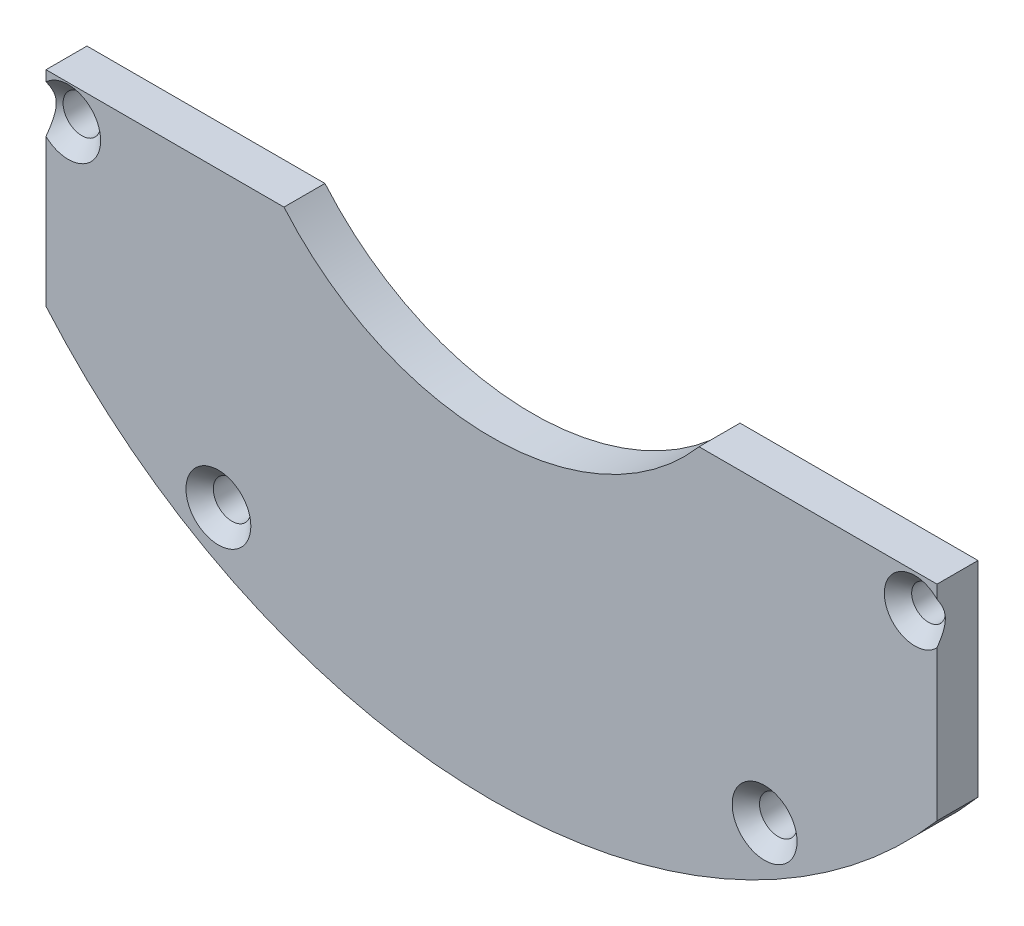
ISO-10303-21;
HEADER;
FILE_DESCRIPTION(('STEP AP214'),'2;1');
FILE_NAME('part.step','',(''),(''),'','','');
FILE_SCHEMA(('AUTOMOTIVE_DESIGN { 1 0 10303 214 1 1 1 1 }'));
ENDSEC;
DATA;
#1=APPLICATION_CONTEXT('core data for automotive mechanical design processes');
#2=APPLICATION_PROTOCOL_DEFINITION('international standard','automotive_design',2000,#1);
#3=PRODUCT_CONTEXT('',#1,'mechanical');
#4=PRODUCT('Part','Part','',(#3));
#5=PRODUCT_RELATED_PRODUCT_CATEGORY('part','',(#4));
#6=PRODUCT_DEFINITION_FORMATION('','',#4);
#7=PRODUCT_DEFINITION_CONTEXT('part definition',#1,'design');
#8=PRODUCT_DEFINITION('design','',#6,#7);
#9=PRODUCT_DEFINITION_SHAPE('','',#8);
#10=(LENGTH_UNIT() NAMED_UNIT(*) SI_UNIT(.MILLI.,.METRE.));
#11=(NAMED_UNIT(*) PLANE_ANGLE_UNIT() SI_UNIT($,.RADIAN.));
#12=(NAMED_UNIT(*) SI_UNIT($,.STERADIAN.) SOLID_ANGLE_UNIT());
#13=UNCERTAINTY_MEASURE_WITH_UNIT(LENGTH_MEASURE(1.E-05),#10,'distance_accuracy_value','');
#14=(GEOMETRIC_REPRESENTATION_CONTEXT(3) GLOBAL_UNCERTAINTY_ASSIGNED_CONTEXT((#13)) GLOBAL_UNIT_ASSIGNED_CONTEXT((#10,
#11,#12)) REPRESENTATION_CONTEXT('',''));
#15=CARTESIAN_POINT('',(0.,0.,0.));
#16=DIRECTION('',(0.,0.,1.));
#17=DIRECTION('',(1.,0.,0.));
#18=AXIS2_PLACEMENT_3D('',#15,#16,#17);
#19=CARTESIAN_POINT('',(-65.25,-26.,6.));
#20=DIRECTION('',(0.,-1.,0.));
#21=DIRECTION('',(1.,0.,0.));
#22=AXIS2_PLACEMENT_3D('',#19,#20,#21);
#23=PLANE('',#22);
#24=DIRECTION('',(-1.,0.,0.));
#25=VECTOR('',#24,1.);
#26=CARTESIAN_POINT('',(-65.25,-26.,0.));
#27=LINE('',#26,#25);
#28=CARTESIAN_POINT('',(-30.3973683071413,-26.,0.));
#29=VERTEX_POINT('',#28);
#30=CARTESIAN_POINT('',(-65.25,-26.,0.));
#31=VERTEX_POINT('',#30);
#32=EDGE_CURVE('E128',#29,#31,#27,.T.);
#33=ORIENTED_EDGE('',*,*,#32,.T.);
#34=DIRECTION('',(0.,0.,-1.));
#35=VECTOR('',#34,1.);
#36=CARTESIAN_POINT('',(-65.25,-26.,6.));
#37=LINE('',#36,#35);
#38=CARTESIAN_POINT('',(-65.25,-26.,6.));
#39=VERTEX_POINT('',#38);
#40=EDGE_CURVE('E109',#39,#31,#37,.T.);
#41=ORIENTED_EDGE('',*,*,#40,.F.);
#42=DIRECTION('',(-1.,0.,0.));
#43=VECTOR('',#42,1.);
#44=CARTESIAN_POINT('',(-65.25,-26.,6.));
#45=LINE('',#44,#43);
#46=CARTESIAN_POINT('',(-30.3973683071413,-26.,6.));
#47=VERTEX_POINT('',#46);
#48=EDGE_CURVE('E118',#47,#39,#45,.T.);
#49=ORIENTED_EDGE('',*,*,#48,.F.);
#50=DIRECTION('',(0.,0.,-1.));
#51=VECTOR('',#50,1.);
#52=CARTESIAN_POINT('',(-30.3973683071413,-26.,6.));
#53=LINE('',#52,#51);
#54=EDGE_CURVE('E350',#47,#29,#53,.T.);
#55=ORIENTED_EDGE('',*,*,#54,.T.);
#56=EDGE_LOOP('',(#33,#41,#49,#55));
#57=FACE_BOUND('',#56,.T.);
#58=ADVANCED_FACE('F35',(#57),#23,.F.);
#59=CARTESIAN_POINT('',(-65.25,-26.,6.));
#60=DIRECTION('',(1.,0.,0.));
#61=DIRECTION('',(0.,0.,-1.));
#62=AXIS2_PLACEMENT_3D('',#59,#60,#61);
#63=PLANE('',#62);
#64=DIRECTION('',(0.,-1.,0.));
#65=VECTOR('',#64,1.);
#66=CARTESIAN_POINT('',(-65.25,-26.,6.));
#67=LINE('',#66,#65);
#68=CARTESIAN_POINT('',(-65.25,-34.4641016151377,6.));
#69=VERTEX_POINT('',#68);
#70=CARTESIAN_POINT('',(-65.25,-56.0217591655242,6.));
#71=VERTEX_POINT('',#70);
#72=EDGE_CURVE('E115',#69,#71,#67,.T.);
#73=ORIENTED_EDGE('',*,*,#72,.F.);
#74=CARTESIAN_POINT('',(-65.25,-34.4641016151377,6.));
#75=CARTESIAN_POINT('',(-65.25,-34.3719398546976,5.93280747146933));
#76=CARTESIAN_POINT('',(-65.25,-34.2791909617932,5.86640449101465));
#77=CARTESIAN_POINT('',(-65.25,-34.092276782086,5.73555140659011));
#78=CARTESIAN_POINT('',(-65.25,-33.9981109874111,5.67110202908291));
#79=CARTESIAN_POINT('',(-65.25,-33.807139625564,5.54388129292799));
#80=CARTESIAN_POINT('',(-65.25,-33.7103163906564,5.48113632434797));
#81=CARTESIAN_POINT('',(-65.25,-33.5148039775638,5.3586408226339));
#82=CARTESIAN_POINT('',(-65.25,-33.4161149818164,5.29888999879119));
#83=CARTESIAN_POINT('',(-65.25,-33.2121673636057,5.1805200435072));
#84=CARTESIAN_POINT('',(-65.25,-33.1068109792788,5.12206710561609));
#85=CARTESIAN_POINT('',(-65.25,-32.8934491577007,5.01023799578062));
#86=CARTESIAN_POINT('',(-65.25,-32.7854432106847,4.95686281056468));
#87=CARTESIAN_POINT('',(-65.25,-32.4578778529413,4.80673331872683));
#88=CARTESIAN_POINT('',(-65.25,-32.2336780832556,4.71931072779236));
#89=CARTESIAN_POINT('',(-65.25,-31.8957625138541,4.6196115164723));
#90=CARTESIAN_POINT('',(-65.25,-31.7865245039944,4.59207234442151));
#91=CARTESIAN_POINT('',(-65.25,-31.5659169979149,4.54713679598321));
#92=CARTESIAN_POINT('',(-65.25,-31.4545472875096,4.52974144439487));
#93=CARTESIAN_POINT('',(-65.25,-31.2324607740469,4.5064635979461));
#94=CARTESIAN_POINT('',(-65.25,-31.1217637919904,4.50039489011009));
#95=CARTESIAN_POINT('',(-65.25,-30.9003322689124,4.49964266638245));
#96=CARTESIAN_POINT('',(-65.25,-30.7895977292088,4.50495878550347));
#97=CARTESIAN_POINT('',(-65.25,-30.5696302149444,4.52654860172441));
#98=CARTESIAN_POINT('',(-65.25,-30.4603932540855,4.54278253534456));
#99=CARTESIAN_POINT('',(-65.25,-30.243862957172,4.58510943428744));
#100=CARTESIAN_POINT('',(-65.25,-30.1365699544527,4.61120407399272));
#101=CARTESIAN_POINT('',(-65.25,-29.9227315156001,4.67232802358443));
#102=CARTESIAN_POINT('',(-65.25,-29.8162256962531,4.70749397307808));
#103=CARTESIAN_POINT('',(-65.25,-29.6059102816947,4.7850293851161));
#104=CARTESIAN_POINT('',(-65.25,-29.502100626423,4.82739868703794));
#105=CARTESIAN_POINT('',(-65.25,-29.2298253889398,4.94766960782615));
#106=CARTESIAN_POINT('',(-65.25,-29.0636119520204,5.03064924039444));
#107=CARTESIAN_POINT('',(-65.25,-28.7371461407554,5.20780232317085));
#108=CARTESIAN_POINT('',(-65.25,-28.5769014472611,5.30198958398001));
#109=CARTESIAN_POINT('',(-65.25,-28.2677351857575,5.49425924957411));
#110=CARTESIAN_POINT('',(-65.25,-28.1186178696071,5.59202943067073));
#111=CARTESIAN_POINT('',(-65.25,-27.8979076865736,5.7425058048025));
#112=CARTESIAN_POINT('',(-65.25,-27.824941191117,5.79322103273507));
#113=CARTESIAN_POINT('',(-65.25,-27.6798301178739,5.89579391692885));
#114=CARTESIAN_POINT('',(-65.25,-27.607685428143,5.94765141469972));
#115=CARTESIAN_POINT('',(-65.25,-27.5358983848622,6.));
#116=B_SPLINE_CURVE_WITH_KNOTS('',3,(#74,#75,#76,#77,#78,#79,#80,#81,#82,#83,#84,#85,#86,#87,
#88,#89,#90,#91,#92,#93,#94,#95,#96,#97,#98,#99,#100,#101,#102,#103,#104,#105,#106,#107,#108,
#109,#110,#111,#112,#113,#114,#115),.UNSPECIFIED.,.F.,.F.,(4,2,2,2,2,2,2,2,2,2,2,2,2,2,2,2,2,2,
2,2,4),(0.,0.342175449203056,0.684476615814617,1.03055784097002,1.37660539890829,
1.73791808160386,2.09930083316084,2.81824374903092,3.15582730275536,3.49344495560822,
3.82546145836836,4.15746731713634,4.48827048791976,4.81912985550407,5.15529788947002,
5.49145842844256,6.04810927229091,6.60545329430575,7.14022586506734,7.4067985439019,
7.67333446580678),.UNSPECIFIED.);
#117=CARTESIAN_POINT('',(-65.25,-27.5358983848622,6.));
#118=VERTEX_POINT('',#117);
#119=EDGE_CURVE('E11',#69,#118,#116,.T.);
#120=ORIENTED_EDGE('',*,*,#119,.T.);
#121=EDGE_CURVE('E104',#39,#118,#67,.T.);
#122=ORIENTED_EDGE('',*,*,#121,.F.);
#123=ORIENTED_EDGE('',*,*,#40,.T.);
#124=DIRECTION('',(0.,-1.,0.));
#125=VECTOR('',#124,1.);
#126=CARTESIAN_POINT('',(-65.25,-26.,0.));
#127=LINE('',#126,#125);
#128=CARTESIAN_POINT('',(-65.25,-56.0217591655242,0.));
#129=VERTEX_POINT('',#128);
#130=EDGE_CURVE('E337',#31,#129,#127,.T.);
#131=ORIENTED_EDGE('',*,*,#130,.T.);
#132=DIRECTION('',(0.,0.,-1.));
#133=VECTOR('',#132,1.);
#134=CARTESIAN_POINT('',(-65.25,-56.0217591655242,6.));
#135=LINE('',#134,#133);
#136=EDGE_CURVE('E130',#71,#129,#135,.T.);
#137=ORIENTED_EDGE('',*,*,#136,.F.);
#138=EDGE_LOOP('',(#73,#120,#122,#123,#131,#137));
#139=FACE_BOUND('',#138,.T.);
#140=ADVANCED_FACE('F107',(#139),#63,.F.);
#141=CARTESIAN_POINT('',(0.,0.,6.));
#142=DIRECTION('',(0.,0.,-1.));
#143=DIRECTION('',(-1.,0.,0.));
#144=AXIS2_PLACEMENT_3D('',#141,#142,#143);
#145=CYLINDRICAL_SURFACE('',#144,86.);
#146=CARTESIAN_POINT('',(0.,0.,0.));
#147=DIRECTION('',(0.,0.,1.));
#148=DIRECTION('',(1.,0.,0.));
#149=AXIS2_PLACEMENT_3D('',#146,#147,#148);
#150=CIRCLE('',#149,86.);
#151=CARTESIAN_POINT('',(65.25,-56.0217591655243,0.));
#152=VERTEX_POINT('',#151);
#153=EDGE_CURVE('E339',#129,#152,#150,.T.);
#154=ORIENTED_EDGE('',*,*,#153,.T.);
#155=DIRECTION('',(0.,0.,-1.));
#156=VECTOR('',#155,1.);
#157=CARTESIAN_POINT('',(65.25,-56.0217591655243,6.));
#158=LINE('',#157,#156);
#159=CARTESIAN_POINT('',(65.25,-56.0217591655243,6.));
#160=VERTEX_POINT('',#159);
#161=EDGE_CURVE('E136',#160,#152,#158,.T.);
#162=ORIENTED_EDGE('',*,*,#161,.F.);
#163=CARTESIAN_POINT('',(0.,0.,6.));
#164=DIRECTION('',(0.,0.,1.));
#165=DIRECTION('',(1.,0.,0.));
#166=AXIS2_PLACEMENT_3D('',#163,#164,#165);
#167=CIRCLE('',#166,86.);
#168=EDGE_CURVE('E114',#71,#160,#167,.T.);
#169=ORIENTED_EDGE('',*,*,#168,.F.);
#170=ORIENTED_EDGE('',*,*,#136,.T.);
#171=EDGE_LOOP('',(#154,#162,#169,#170));
#172=FACE_BOUND('',#171,.T.);
#173=ADVANCED_FACE('F179',(#172),#145,.T.);
#174=CARTESIAN_POINT('',(65.2499999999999,-26.,6.));
#175=DIRECTION('',(-1.,0.,0.));
#176=DIRECTION('',(0.,-1.,0.));
#177=AXIS2_PLACEMENT_3D('',#174,#175,#176);
#178=PLANE('',#177);
#179=DIRECTION('',(0.,1.,0.));
#180=VECTOR('',#179,1.);
#181=CARTESIAN_POINT('',(65.2499999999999,-26.,6.));
#182=LINE('',#181,#180);
#183=CARTESIAN_POINT('',(65.2499999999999,-27.9340869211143,6.));
#184=VERTEX_POINT('',#183);
#185=CARTESIAN_POINT('',(65.2499999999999,-26.,6.));
#186=VERTEX_POINT('',#185);
#187=EDGE_CURVE('E366',#184,#186,#182,.T.);
#188=ORIENTED_EDGE('',*,*,#187,.F.);
#189=CARTESIAN_POINT('',(65.2499999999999,-27.9340869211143,6.));
#190=CARTESIAN_POINT('',(65.2499999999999,-28.0239770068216,5.93833885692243));
#191=CARTESIAN_POINT('',(65.2499999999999,-28.1145283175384,5.87761683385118));
#192=CARTESIAN_POINT('',(65.2499999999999,-28.2972185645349,5.758504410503));
#193=CARTESIAN_POINT('',(65.2499999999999,-28.3893583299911,5.70011528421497));
#194=CARTESIAN_POINT('',(65.2499999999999,-28.5766630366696,5.58541255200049));
#195=CARTESIAN_POINT('',(65.2499999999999,-28.6718520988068,5.52913812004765));
#196=CARTESIAN_POINT('',(65.2499999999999,-28.8642716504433,5.42020686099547));
#197=CARTESIAN_POINT('',(65.2499999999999,-28.9615018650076,5.36754955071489));
#198=CARTESIAN_POINT('',(65.2499999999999,-29.1601102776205,5.26574797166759));
#199=CARTESIAN_POINT('',(65.2499999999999,-29.2615320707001,5.2166881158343));
#200=CARTESIAN_POINT('',(65.2499999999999,-29.4670050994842,5.1243134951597));
#201=CARTESIAN_POINT('',(65.2499999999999,-29.5710567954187,5.08099974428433));
#202=CARTESIAN_POINT('',(65.2499999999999,-29.7813019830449,5.00170427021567));
#203=CARTESIAN_POINT('',(65.2499999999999,-29.8874807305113,4.96568391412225));
#204=CARTESIAN_POINT('',(65.2499999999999,-30.102335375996,4.90221013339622));
#205=CARTESIAN_POINT('',(65.2499999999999,-30.2110096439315,4.87475127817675));
#206=CARTESIAN_POINT('',(65.2499999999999,-30.4261315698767,4.83074324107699));
#207=CARTESIAN_POINT('',(65.2499999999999,-30.5324990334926,4.81380792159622));
#208=CARTESIAN_POINT('',(65.2499999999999,-30.7464276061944,4.7902225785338));
#209=CARTESIAN_POINT('',(65.2499999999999,-30.8539891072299,4.78357603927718));
#210=CARTESIAN_POINT('',(65.2499999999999,-31.0679495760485,4.78104944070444));
#211=CARTESIAN_POINT('',(65.2499999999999,-31.1743470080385,4.78504116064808));
#212=CARTESIAN_POINT('',(65.2499999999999,-31.3862484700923,4.8032453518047));
#213=CARTESIAN_POINT('',(65.2499999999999,-31.4917524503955,4.81745838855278));
#214=CARTESIAN_POINT('',(65.2499999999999,-31.7247903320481,4.8595218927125));
#215=CARTESIAN_POINT('',(65.2499999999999,-31.8518953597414,4.88973376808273));
#216=CARTESIAN_POINT('',(65.2499999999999,-32.1027008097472,4.96194447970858));
#217=CARTESIAN_POINT('',(65.2499999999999,-32.2263993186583,5.00394979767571));
#218=CARTESIAN_POINT('',(65.2499999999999,-32.4716371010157,5.09791968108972));
#219=CARTESIAN_POINT('',(65.2499999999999,-32.593131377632,5.1499999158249));
#220=CARTESIAN_POINT('',(65.2499999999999,-32.8325695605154,5.26163456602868));
#221=CARTESIAN_POINT('',(65.2499999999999,-32.9505140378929,5.32118777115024));
#222=CARTESIAN_POINT('',(65.2499999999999,-33.1539940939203,5.43038550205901));
#223=CARTESIAN_POINT('',(65.2499999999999,-33.2402214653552,5.47875608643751));
#224=CARTESIAN_POINT('',(65.2499999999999,-33.4110971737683,5.57819537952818));
#225=CARTESIAN_POINT('',(65.2499999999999,-33.4957455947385,5.62926394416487));
#226=CARTESIAN_POINT('',(65.2499999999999,-33.6619848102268,5.7326144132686));
#227=CARTESIAN_POINT('',(65.2499999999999,-33.7436029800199,5.78485249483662));
#228=CARTESIAN_POINT('',(65.2499999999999,-33.9056260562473,5.89114442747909));
#229=CARTESIAN_POINT('',(65.2499999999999,-33.9860312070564,5.94519790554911));
#230=CARTESIAN_POINT('',(65.2499999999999,-34.0659130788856,6.));
#231=B_SPLINE_CURVE_WITH_KNOTS('',3,(#189,#190,#191,#192,#193,#194,#195,#196,#197,#198,#199,
#200,#201,#202,#203,#204,#205,#206,#207,#208,#209,#210,#211,#212,#213,#214,#215,#216,#217,#218,
#219,#220,#221,#222,#223,#224,#225,#226,#227,#228,#229,#230),.UNSPECIFIED.,.F.,.F.,(4,2,2,2,2,2,
2,2,2,2,2,2,2,2,2,2,2,2,2,2,4),(0.,0.327033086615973,0.654242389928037,0.985914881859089,
1.3175429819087,1.65539098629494,1.99329852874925,2.32936645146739,2.66522076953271,
2.98788378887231,3.31065605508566,3.62955566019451,3.94847291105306,4.33969985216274,
4.73114223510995,5.12737855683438,5.52355078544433,5.8201034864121,6.11664036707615,
6.40732619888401,6.69795266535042),.UNSPECIFIED.);
#232=CARTESIAN_POINT('',(65.2499999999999,-34.0659130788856,6.));
#233=VERTEX_POINT('',#232);
#234=EDGE_CURVE('E54',#184,#233,#231,.T.);
#235=ORIENTED_EDGE('',*,*,#234,.T.);
#236=EDGE_CURVE('E361',#160,#233,#182,.T.);
#237=ORIENTED_EDGE('',*,*,#236,.F.);
#238=ORIENTED_EDGE('',*,*,#161,.T.);
#239=DIRECTION('',(0.,1.,0.));
#240=VECTOR('',#239,1.);
#241=CARTESIAN_POINT('',(65.2499999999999,-26.,0.));
#242=LINE('',#241,#240);
#243=CARTESIAN_POINT('',(65.2499999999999,-26.,0.));
#244=VERTEX_POINT('',#243);
#245=EDGE_CURVE('E345',#152,#244,#242,.T.);
#246=ORIENTED_EDGE('',*,*,#245,.T.);
#247=DIRECTION('',(0.,0.,-1.));
#248=VECTOR('',#247,1.);
#249=CARTESIAN_POINT('',(65.2499999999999,-26.,6.));
#250=LINE('',#249,#248);
#251=EDGE_CURVE('E355',#186,#244,#250,.T.);
#252=ORIENTED_EDGE('',*,*,#251,.F.);
#253=EDGE_LOOP('',(#188,#235,#237,#238,#246,#252));
#254=FACE_BOUND('',#253,.T.);
#255=ADVANCED_FACE('F173',(#254),#178,.F.);
#256=CARTESIAN_POINT('',(30.3973683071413,-26.,6.));
#257=DIRECTION('',(0.,-1.,0.));
#258=DIRECTION('',(1.,0.,0.));
#259=AXIS2_PLACEMENT_3D('',#256,#257,#258);
#260=PLANE('',#259);
#261=DIRECTION('',(-1.,0.,0.));
#262=VECTOR('',#261,1.);
#263=CARTESIAN_POINT('',(30.3973683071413,-26.,0.));
#264=LINE('',#263,#262);
#265=CARTESIAN_POINT('',(30.3973683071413,-26.,0.));
#266=VERTEX_POINT('',#265);
#267=EDGE_CURVE('E347',#244,#266,#264,.T.);
#268=ORIENTED_EDGE('',*,*,#267,.T.);
#269=DIRECTION('',(0.,0.,-1.));
#270=VECTOR('',#269,1.);
#271=CARTESIAN_POINT('',(30.3973683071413,-26.,6.));
#272=LINE('',#271,#270);
#273=CARTESIAN_POINT('',(30.3973683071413,-26.,6.));
#274=VERTEX_POINT('',#273);
#275=EDGE_CURVE('E352',#274,#266,#272,.T.);
#276=ORIENTED_EDGE('',*,*,#275,.F.);
#277=DIRECTION('',(-1.,0.,0.));
#278=VECTOR('',#277,1.);
#279=CARTESIAN_POINT('',(30.3973683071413,-26.,6.));
#280=LINE('',#279,#278);
#281=EDGE_CURVE('E365',#186,#274,#280,.T.);
#282=ORIENTED_EDGE('',*,*,#281,.F.);
#283=ORIENTED_EDGE('',*,*,#251,.T.);
#284=EDGE_LOOP('',(#268,#276,#282,#283));
#285=FACE_BOUND('',#284,.T.);
#286=ADVANCED_FACE('F178',(#285),#260,.F.);
#287=CARTESIAN_POINT('',(0.,0.,6.));
#288=DIRECTION('',(0.,0.,-1.));
#289=DIRECTION('',(-1.,0.,0.));
#290=AXIS2_PLACEMENT_3D('',#287,#288,#289);
#291=CYLINDRICAL_SURFACE('',#290,40.);
#292=CARTESIAN_POINT('',(0.,0.,0.));
#293=DIRECTION('',(0.,0.,-1.));
#294=DIRECTION('',(1.,0.,0.));
#295=AXIS2_PLACEMENT_3D('',#292,#293,#294);
#296=CIRCLE('',#295,40.);
#297=EDGE_CURVE('E125',#266,#29,#296,.T.);
#298=ORIENTED_EDGE('',*,*,#297,.T.);
#299=ORIENTED_EDGE('',*,*,#54,.F.);
#300=CARTESIAN_POINT('',(0.,0.,6.));
#301=DIRECTION('',(0.,0.,-1.));
#302=DIRECTION('',(1.,0.,0.));
#303=AXIS2_PLACEMENT_3D('',#300,#301,#302);
#304=CIRCLE('',#303,40.);
#305=EDGE_CURVE('E121',#274,#47,#304,.T.);
#306=ORIENTED_EDGE('',*,*,#305,.F.);
#307=ORIENTED_EDGE('',*,*,#275,.T.);
#308=EDGE_LOOP('',(#298,#299,#306,#307));
#309=FACE_BOUND('',#308,.T.);
#310=ADVANCED_FACE('F208',(#309),#291,.F.);
#311=CARTESIAN_POINT('',(0.,0.,6.));
#312=DIRECTION('',(0.,0.,1.));
#313=DIRECTION('',(1.,0.,0.));
#314=AXIS2_PLACEMENT_3D('',#311,#312,#313);
#315=PLANE('',#314);
#316=CARTESIAN_POINT('',(40.,-68.9092960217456,6.));
#317=DIRECTION('',(0.,0.,1.));
#318=DIRECTION('',(1.,0.,0.));
#319=AXIS2_PLACEMENT_3D('',#316,#317,#318);
#320=CIRCLE('',#319,4.75);
#321=CARTESIAN_POINT('',(44.75,-68.9092960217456,6.));
#322=VERTEX_POINT('',#321);
#323=EDGE_CURVE('E156',#322,#322,#320,.F.);
#324=ORIENTED_EDGE('',*,*,#323,.T.);
#325=EDGE_LOOP('',(#324));
#326=FACE_BOUND('',#325,.T.);
#327=CARTESIAN_POINT('',(-40.,-68.9092960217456,6.));
#328=DIRECTION('',(0.,0.,1.));
#329=DIRECTION('',(1.,0.,0.));
#330=AXIS2_PLACEMENT_3D('',#327,#328,#329);
#331=CIRCLE('',#330,4.75);
#332=CARTESIAN_POINT('',(-35.25,-68.9092960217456,6.));
#333=VERTEX_POINT('',#332);
#334=EDGE_CURVE('E153',#333,#333,#331,.F.);
#335=ORIENTED_EDGE('',*,*,#334,.T.);
#336=EDGE_LOOP('',(#335));
#337=FACE_BOUND('',#336,.T.);
#338=ORIENTED_EDGE('',*,*,#236,.T.);
#339=CARTESIAN_POINT('',(62.,-31.,6.));
#340=DIRECTION('',(0.,0.,1.));
#341=DIRECTION('',(1.,0.,0.));
#342=AXIS2_PLACEMENT_3D('',#339,#340,#341);
#343=CIRCLE('',#342,4.46792155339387);
#344=EDGE_CURVE('E159',#233,#184,#343,.F.);
#345=ORIENTED_EDGE('',*,*,#344,.T.);
#346=ORIENTED_EDGE('',*,*,#187,.T.);
#347=ORIENTED_EDGE('',*,*,#281,.T.);
#348=ORIENTED_EDGE('',*,*,#305,.T.);
#349=ORIENTED_EDGE('',*,*,#48,.T.);
#350=ORIENTED_EDGE('',*,*,#121,.T.);
#351=CARTESIAN_POINT('',(-62.,-31.,6.));
#352=DIRECTION('',(0.,0.,1.));
#353=DIRECTION('',(1.,0.,0.));
#354=AXIS2_PLACEMENT_3D('',#351,#352,#353);
#355=CIRCLE('',#354,4.75000000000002);
#356=EDGE_CURVE('E133',#118,#69,#355,.F.);
#357=ORIENTED_EDGE('',*,*,#356,.T.);
#358=ORIENTED_EDGE('',*,*,#72,.T.);
#359=ORIENTED_EDGE('',*,*,#168,.T.);
#360=EDGE_LOOP('',(#338,#345,#346,#347,#348,#349,#350,#357,#358,#359));
#361=FACE_BOUND('',#360,.T.);
#362=ADVANCED_FACE('F119',(#326,#337,#361),#315,.T.);
#363=CARTESIAN_POINT('',(0.,0.,0.));
#364=DIRECTION('',(0.,0.,1.));
#365=DIRECTION('',(1.,0.,0.));
#366=AXIS2_PLACEMENT_3D('',#363,#364,#365);
#367=PLANE('',#366);
#368=CARTESIAN_POINT('',(62.,-31.,0.));
#369=DIRECTION('',(0.,0.,1.));
#370=DIRECTION('',(1.,0.,0.));
#371=AXIS2_PLACEMENT_3D('',#368,#369,#370);
#372=CIRCLE('',#371,2.46792155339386);
#373=CARTESIAN_POINT('',(64.4679215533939,-31.,0.));
#374=VERTEX_POINT('',#373);
#375=EDGE_CURVE('E149',#374,#374,#372,.T.);
#376=ORIENTED_EDGE('',*,*,#375,.T.);
#377=EDGE_LOOP('',(#376));
#378=FACE_BOUND('',#377,.T.);
#379=CARTESIAN_POINT('',(-62.,-31.,0.));
#380=DIRECTION('',(0.,0.,1.));
#381=DIRECTION('',(1.,0.,0.));
#382=AXIS2_PLACEMENT_3D('',#379,#380,#381);
#383=CIRCLE('',#382,2.75);
#384=CARTESIAN_POINT('',(-59.25,-31.,0.));
#385=VERTEX_POINT('',#384);
#386=EDGE_CURVE('E146',#385,#385,#383,.T.);
#387=ORIENTED_EDGE('',*,*,#386,.T.);
#388=EDGE_LOOP('',(#387));
#389=FACE_BOUND('',#388,.T.);
#390=CARTESIAN_POINT('',(40.,-68.9092960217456,0.));
#391=DIRECTION('',(0.,0.,1.));
#392=DIRECTION('',(1.,0.,0.));
#393=AXIS2_PLACEMENT_3D('',#390,#391,#392);
#394=CIRCLE('',#393,2.75);
#395=CARTESIAN_POINT('',(42.75,-68.9092960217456,0.));
#396=VERTEX_POINT('',#395);
#397=EDGE_CURVE('E143',#396,#396,#394,.T.);
#398=ORIENTED_EDGE('',*,*,#397,.T.);
#399=EDGE_LOOP('',(#398));
#400=FACE_BOUND('',#399,.T.);
#401=CARTESIAN_POINT('',(-40.,-68.9092960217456,0.));
#402=DIRECTION('',(0.,0.,1.));
#403=DIRECTION('',(1.,0.,0.));
#404=AXIS2_PLACEMENT_3D('',#401,#402,#403);
#405=CIRCLE('',#404,2.75);
#406=CARTESIAN_POINT('',(-37.25,-68.9092960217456,0.));
#407=VERTEX_POINT('',#406);
#408=EDGE_CURVE('E140',#407,#407,#405,.T.);
#409=ORIENTED_EDGE('',*,*,#408,.T.);
#410=EDGE_LOOP('',(#409));
#411=FACE_BOUND('',#410,.T.);
#412=ORIENTED_EDGE('',*,*,#32,.F.);
#413=ORIENTED_EDGE('',*,*,#297,.F.);
#414=ORIENTED_EDGE('',*,*,#267,.F.);
#415=ORIENTED_EDGE('',*,*,#245,.F.);
#416=ORIENTED_EDGE('',*,*,#153,.F.);
#417=ORIENTED_EDGE('',*,*,#130,.F.);
#418=EDGE_LOOP('',(#412,#413,#414,#415,#416,#417));
#419=FACE_BOUND('',#418,.T.);
#420=ADVANCED_FACE('F220',(#378,#389,#400,#411,#419),#367,.F.);
#421=CARTESIAN_POINT('',(-40.,-68.9092960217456,-4.));
#422=DIRECTION('',(0.,0.,1.));
#423=DIRECTION('',(1.,0.,0.));
#424=AXIS2_PLACEMENT_3D('',#421,#422,#423);
#425=CYLINDRICAL_SURFACE('',#424,2.75);
#426=CARTESIAN_POINT('',(-40.,-68.9092960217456,4.00000000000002));
#427=DIRECTION('',(0.,0.,1.));
#428=DIRECTION('',(1.,0.,0.));
#429=AXIS2_PLACEMENT_3D('',#426,#427,#428);
#430=CIRCLE('',#429,2.75);
#431=CARTESIAN_POINT('',(-37.25,-68.9092960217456,4.00000000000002));
#432=VERTEX_POINT('',#431);
#433=EDGE_CURVE('E322',#432,#432,#430,.T.);
#434=ORIENTED_EDGE('',*,*,#433,.T.);
#435=EDGE_LOOP('',(#434));
#436=FACE_BOUND('',#435,.T.);
#437=ORIENTED_EDGE('',*,*,#408,.F.);
#438=EDGE_LOOP('',(#437));
#439=FACE_BOUND('',#438,.T.);
#440=ADVANCED_FACE('F228',(#436,#439),#425,.F.);
#441=CARTESIAN_POINT('',(40.,-68.9092960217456,-4.));
#442=DIRECTION('',(0.,0.,1.));
#443=DIRECTION('',(1.,0.,0.));
#444=AXIS2_PLACEMENT_3D('',#441,#442,#443);
#445=CYLINDRICAL_SURFACE('',#444,2.75);
#446=CARTESIAN_POINT('',(40.,-68.9092960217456,4.00000000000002));
#447=DIRECTION('',(0.,0.,1.));
#448=DIRECTION('',(1.,0.,0.));
#449=AXIS2_PLACEMENT_3D('',#446,#447,#448);
#450=CIRCLE('',#449,2.75);
#451=CARTESIAN_POINT('',(42.75,-68.9092960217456,4.00000000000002));
#452=VERTEX_POINT('',#451);
#453=EDGE_CURVE('E167',#452,#452,#450,.T.);
#454=ORIENTED_EDGE('',*,*,#453,.T.);
#455=EDGE_LOOP('',(#454));
#456=FACE_BOUND('',#455,.T.);
#457=ORIENTED_EDGE('',*,*,#397,.F.);
#458=EDGE_LOOP('',(#457));
#459=FACE_BOUND('',#458,.T.);
#460=ADVANCED_FACE('F235',(#456,#459),#445,.F.);
#461=CARTESIAN_POINT('',(-62.,-31.,-4.));
#462=DIRECTION('',(0.,0.,1.));
#463=DIRECTION('',(1.,0.,0.));
#464=AXIS2_PLACEMENT_3D('',#461,#462,#463);
#465=CYLINDRICAL_SURFACE('',#464,2.75);
#466=CARTESIAN_POINT('',(-62.,-31.,3.99999999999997));
#467=DIRECTION('',(0.,0.,1.));
#468=DIRECTION('',(1.,0.,0.));
#469=AXIS2_PLACEMENT_3D('',#466,#467,#468);
#470=CIRCLE('',#469,2.75);
#471=CARTESIAN_POINT('',(-59.25,-31.,3.99999999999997));
#472=VERTEX_POINT('',#471);
#473=EDGE_CURVE('E48',#472,#472,#470,.T.);
#474=ORIENTED_EDGE('',*,*,#473,.T.);
#475=EDGE_LOOP('',(#474));
#476=FACE_BOUND('',#475,.T.);
#477=ORIENTED_EDGE('',*,*,#386,.F.);
#478=EDGE_LOOP('',(#477));
#479=FACE_BOUND('',#478,.T.);
#480=ADVANCED_FACE('F243',(#476,#479),#465,.F.);
#481=CARTESIAN_POINT('',(62.,-31.,-4.));
#482=DIRECTION('',(0.,0.,1.));
#483=DIRECTION('',(1.,0.,0.));
#484=AXIS2_PLACEMENT_3D('',#481,#482,#483);
#485=CYLINDRICAL_SURFACE('',#484,2.46792155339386);
#486=CARTESIAN_POINT('',(62.,-31.,4.00000000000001));
#487=DIRECTION('',(0.,0.,1.));
#488=DIRECTION('',(1.,0.,0.));
#489=AXIS2_PLACEMENT_3D('',#486,#487,#488);
#490=CIRCLE('',#489,2.46792155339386);
#491=CARTESIAN_POINT('',(64.4679215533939,-31.,4.00000000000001));
#492=VERTEX_POINT('',#491);
#493=EDGE_CURVE('E129',#492,#492,#490,.T.);
#494=ORIENTED_EDGE('',*,*,#493,.T.);
#495=EDGE_LOOP('',(#494));
#496=FACE_BOUND('',#495,.T.);
#497=ORIENTED_EDGE('',*,*,#375,.F.);
#498=EDGE_LOOP('',(#497));
#499=FACE_BOUND('',#498,.T.);
#500=ADVANCED_FACE('F251',(#496,#499),#485,.F.);
#501=CARTESIAN_POINT('',(62.,-31.,4.00000000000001));
#502=DIRECTION('',(0.,0.,1.));
#503=DIRECTION('',(1.,0.,0.));
#504=AXIS2_PLACEMENT_3D('',#501,#502,#503);
#505=CONICAL_SURFACE('',#504,2.46792155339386,0.785398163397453);
#506=ORIENTED_EDGE('',*,*,#234,.F.);
#507=ORIENTED_EDGE('',*,*,#344,.F.);
#508=EDGE_LOOP('',(#506,#507));
#509=FACE_BOUND('',#508,.T.);
#510=ORIENTED_EDGE('',*,*,#493,.F.);
#511=EDGE_LOOP('',(#510));
#512=FACE_BOUND('',#511,.T.);
#513=ADVANCED_FACE('F169',(#509,#512),#505,.F.);
#514=CARTESIAN_POINT('',(40.,-68.9092960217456,4.00000000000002));
#515=DIRECTION('',(0.,0.,1.));
#516=DIRECTION('',(1.,0.,0.));
#517=AXIS2_PLACEMENT_3D('',#514,#515,#516);
#518=CONICAL_SURFACE('',#517,2.75,0.785398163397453);
#519=ORIENTED_EDGE('',*,*,#323,.F.);
#520=EDGE_LOOP('',(#519));
#521=FACE_BOUND('',#520,.T.);
#522=ORIENTED_EDGE('',*,*,#453,.F.);
#523=EDGE_LOOP('',(#522));
#524=FACE_BOUND('',#523,.T.);
#525=ADVANCED_FACE('F266',(#521,#524),#518,.F.);
#526=CARTESIAN_POINT('',(-40.,-68.9092960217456,4.00000000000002));
#527=DIRECTION('',(0.,0.,1.));
#528=DIRECTION('',(1.,0.,0.));
#529=AXIS2_PLACEMENT_3D('',#526,#527,#528);
#530=CONICAL_SURFACE('',#529,2.75,0.785398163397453);
#531=ORIENTED_EDGE('',*,*,#334,.F.);
#532=EDGE_LOOP('',(#531));
#533=FACE_BOUND('',#532,.T.);
#534=ORIENTED_EDGE('',*,*,#433,.F.);
#535=EDGE_LOOP('',(#534));
#536=FACE_BOUND('',#535,.T.);
#537=ADVANCED_FACE('F272',(#533,#536),#530,.F.);
#538=CARTESIAN_POINT('',(-62.,-31.,3.99999999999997));
#539=DIRECTION('',(0.,0.,1.));
#540=DIRECTION('',(1.,0.,0.));
#541=AXIS2_PLACEMENT_3D('',#538,#539,#540);
#542=CONICAL_SURFACE('',#541,2.75,0.785398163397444);
#543=ORIENTED_EDGE('',*,*,#119,.F.);
#544=ORIENTED_EDGE('',*,*,#356,.F.);
#545=EDGE_LOOP('',(#543,#544));
#546=FACE_BOUND('',#545,.T.);
#547=ORIENTED_EDGE('',*,*,#473,.F.);
#548=EDGE_LOOP('',(#547));
#549=FACE_BOUND('',#548,.T.);
#550=ADVANCED_FACE('F37',(#546,#549),#542,.F.);
#551=CLOSED_SHELL('',(#58,#140,#173,#255,#286,#310,#362,#420,#440,#460,#480,#500,#513,#525,#537,#550));
#552=MANIFOLD_SOLID_BREP('B2',#551);
#553=ADVANCED_BREP_SHAPE_REPRESENTATION('',(#18,#552),#14);
#554=SHAPE_DEFINITION_REPRESENTATION(#9,#553);
ENDSEC;
END-ISO-10303-21;
